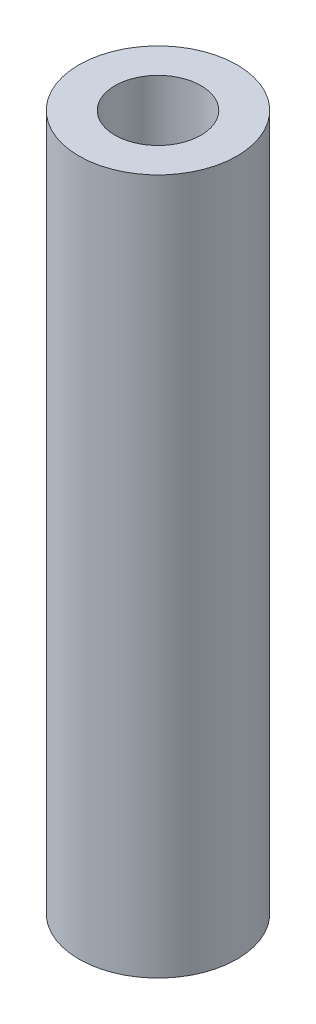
ISO-10303-21;
HEADER;
FILE_DESCRIPTION(('STEP AP214'),'2;1');
FILE_NAME('part.step','',(''),(''),'','','');
FILE_SCHEMA(('AUTOMOTIVE_DESIGN { 1 0 10303 214 1 1 1 1 }'));
ENDSEC;
DATA;
#1=APPLICATION_CONTEXT('core data for automotive mechanical design processes');
#2=APPLICATION_PROTOCOL_DEFINITION('international standard','automotive_design',2000,#1);
#3=PRODUCT_CONTEXT('',#1,'mechanical');
#4=PRODUCT('Part','Part','',(#3));
#5=PRODUCT_RELATED_PRODUCT_CATEGORY('part','',(#4));
#6=PRODUCT_DEFINITION_FORMATION('','',#4);
#7=PRODUCT_DEFINITION_CONTEXT('part definition',#1,'design');
#8=PRODUCT_DEFINITION('design','',#6,#7);
#9=PRODUCT_DEFINITION_SHAPE('','',#8);
#10=(LENGTH_UNIT() NAMED_UNIT(*) SI_UNIT(.MILLI.,.METRE.));
#11=(NAMED_UNIT(*) PLANE_ANGLE_UNIT() SI_UNIT($,.RADIAN.));
#12=(NAMED_UNIT(*) SI_UNIT($,.STERADIAN.) SOLID_ANGLE_UNIT());
#13=UNCERTAINTY_MEASURE_WITH_UNIT(LENGTH_MEASURE(1.E-05),#10,'distance_accuracy_value','');
#14=(GEOMETRIC_REPRESENTATION_CONTEXT(3) GLOBAL_UNCERTAINTY_ASSIGNED_CONTEXT((#13)) GLOBAL_UNIT_ASSIGNED_CONTEXT((#10,
#11,#12)) REPRESENTATION_CONTEXT('',''));
#15=CARTESIAN_POINT('',(0.,0.,0.));
#16=DIRECTION('',(0.,0.,1.));
#17=DIRECTION('',(1.,0.,0.));
#18=AXIS2_PLACEMENT_3D('',#15,#16,#17);
#19=CARTESIAN_POINT('',(0.,-27.94,0.));
#20=DIRECTION('',(0.,1.,0.));
#21=DIRECTION('',(0.,0.,1.));
#22=AXIS2_PLACEMENT_3D('',#19,#20,#21);
#23=CYLINDRICAL_SURFACE('',#22,3.175);
#24=CARTESIAN_POINT('',(0.,-27.94,0.));
#25=DIRECTION('',(0.,1.,0.));
#26=DIRECTION('',(0.,0.,1.));
#27=AXIS2_PLACEMENT_3D('',#24,#25,#26);
#28=CIRCLE('',#27,3.175);
#29=CARTESIAN_POINT('',(0.,-27.94,3.175));
#30=VERTEX_POINT('',#29);
#31=EDGE_CURVE('E11',#30,#30,#28,.T.);
#32=ORIENTED_EDGE('',*,*,#31,.T.);
#33=EDGE_LOOP('',(#32));
#34=FACE_BOUND('',#33,.T.);
#35=CARTESIAN_POINT('',(0.,0.,0.));
#36=DIRECTION('',(0.,1.,0.));
#37=DIRECTION('',(0.,0.,1.));
#38=AXIS2_PLACEMENT_3D('',#35,#36,#37);
#39=CIRCLE('',#38,3.175);
#40=CARTESIAN_POINT('',(0.,0.,3.175));
#41=VERTEX_POINT('',#40);
#42=EDGE_CURVE('E40',#41,#41,#39,.T.);
#43=ORIENTED_EDGE('',*,*,#42,.F.);
#44=EDGE_LOOP('',(#43));
#45=FACE_BOUND('',#44,.T.);
#46=ADVANCED_FACE('F37',(#34,#45),#23,.T.);
#47=CARTESIAN_POINT('',(0.,-27.94,0.));
#48=DIRECTION('',(0.,1.,0.));
#49=DIRECTION('',(0.,0.,1.));
#50=AXIS2_PLACEMENT_3D('',#47,#48,#49);
#51=PLANE('',#50);
#52=CARTESIAN_POINT('',(0.,-27.94,0.));
#53=DIRECTION('',(0.,-1.,0.));
#54=DIRECTION('',(0.,0.,-1.));
#55=AXIS2_PLACEMENT_3D('',#52,#53,#54);
#56=CIRCLE('',#55,1.72719999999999);
#57=CARTESIAN_POINT('',(0.,-27.94,-1.72719999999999));
#58=VERTEX_POINT('',#57);
#59=EDGE_CURVE('E59',#58,#58,#56,.T.);
#60=ORIENTED_EDGE('',*,*,#59,.F.);
#61=EDGE_LOOP('',(#60));
#62=FACE_BOUND('',#61,.T.);
#63=ORIENTED_EDGE('',*,*,#31,.F.);
#64=EDGE_LOOP('',(#63));
#65=FACE_BOUND('',#64,.T.);
#66=ADVANCED_FACE('F77',(#62,#65),#51,.F.);
#67=CARTESIAN_POINT('',(0.,0.,0.));
#68=DIRECTION('',(0.,1.,0.));
#69=DIRECTION('',(0.,0.,1.));
#70=AXIS2_PLACEMENT_3D('',#67,#68,#69);
#71=PLANE('',#70);
#72=CARTESIAN_POINT('',(0.,0.,0.));
#73=DIRECTION('',(0.,1.,0.));
#74=DIRECTION('',(0.,0.,1.));
#75=AXIS2_PLACEMENT_3D('',#72,#73,#74);
#76=CIRCLE('',#75,1.72719999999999);
#77=CARTESIAN_POINT('',(0.,0.,1.72719999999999));
#78=VERTEX_POINT('',#77);
#79=EDGE_CURVE('E67',#78,#78,#76,.T.);
#80=ORIENTED_EDGE('',*,*,#79,.F.);
#81=EDGE_LOOP('',(#80));
#82=FACE_BOUND('',#81,.T.);
#83=ORIENTED_EDGE('',*,*,#42,.T.);
#84=EDGE_LOOP('',(#83));
#85=FACE_BOUND('',#84,.T.);
#86=ADVANCED_FACE('F74',(#82,#85),#71,.T.);
#87=CARTESIAN_POINT('',(0.,0.,0.));
#88=DIRECTION('',(0.,1.,0.));
#89=DIRECTION('',(0.,0.,1.));
#90=AXIS2_PLACEMENT_3D('',#87,#88,#89);
#91=CYLINDRICAL_SURFACE('',#90,1.72719999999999);
#92=CARTESIAN_POINT('',(0.,-12.2936,0.));
#93=DIRECTION('',(0.,1.,0.));
#94=DIRECTION('',(0.,0.,1.));
#95=AXIS2_PLACEMENT_3D('',#92,#93,#94);
#96=CIRCLE('',#95,1.72719999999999);
#97=CARTESIAN_POINT('',(0.,-12.2936,1.72719999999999));
#98=VERTEX_POINT('',#97);
#99=EDGE_CURVE('E62',#98,#98,#96,.T.);
#100=ORIENTED_EDGE('',*,*,#99,.F.);
#101=EDGE_LOOP('',(#100));
#102=FACE_BOUND('',#101,.T.);
#103=ORIENTED_EDGE('',*,*,#79,.T.);
#104=EDGE_LOOP('',(#103));
#105=FACE_BOUND('',#104,.T.);
#106=ADVANCED_FACE('F89',(#102,#105),#91,.F.);
#107=CARTESIAN_POINT('',(0.,-12.2936,0.));
#108=DIRECTION('',(0.,1.,0.));
#109=DIRECTION('',(0.,0.,1.));
#110=AXIS2_PLACEMENT_3D('',#107,#108,#109);
#111=CONICAL_SURFACE('',#110,1.72719999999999,1.02974425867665);
#112=CARTESIAN_POINT('',(0.,-13.3314064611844,0.));
#113=VERTEX_POINT('',#112);
#114=VERTEX_LOOP('',#113);
#115=FACE_BOUND('',#114,.T.);
#116=ORIENTED_EDGE('',*,*,#99,.T.);
#117=EDGE_LOOP('',(#116));
#118=FACE_BOUND('',#117,.T.);
#119=ADVANCED_FACE('F95',(#115,#118),#111,.F.);
#120=CARTESIAN_POINT('',(0.,-27.94,0.));
#121=DIRECTION('',(0.,-1.,0.));
#122=DIRECTION('',(0.,0.,-1.));
#123=AXIS2_PLACEMENT_3D('',#120,#121,#122);
#124=CYLINDRICAL_SURFACE('',#123,1.72719999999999);
#125=CARTESIAN_POINT('',(0.,-15.6464,0.));
#126=DIRECTION('',(0.,-1.,0.));
#127=DIRECTION('',(0.,0.,-1.));
#128=AXIS2_PLACEMENT_3D('',#125,#126,#127);
#129=CIRCLE('',#128,1.72719999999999);
#130=CARTESIAN_POINT('',(0.,-15.6464,-1.72719999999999));
#131=VERTEX_POINT('',#130);
#132=EDGE_CURVE('E57',#131,#131,#129,.T.);
#133=ORIENTED_EDGE('',*,*,#132,.F.);
#134=EDGE_LOOP('',(#133));
#135=FACE_BOUND('',#134,.T.);
#136=ORIENTED_EDGE('',*,*,#59,.T.);
#137=EDGE_LOOP('',(#136));
#138=FACE_BOUND('',#137,.T.);
#139=ADVANCED_FACE('F53',(#135,#138),#124,.F.);
#140=CARTESIAN_POINT('',(0.,-15.6464,0.));
#141=DIRECTION('',(0.,-1.,0.));
#142=DIRECTION('',(0.,0.,-1.));
#143=AXIS2_PLACEMENT_3D('',#140,#141,#142);
#144=CONICAL_SURFACE('',#143,1.72719999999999,1.02974425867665);
#145=CARTESIAN_POINT('',(0.,-14.6085935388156,0.));
#146=VERTEX_POINT('',#145);
#147=VERTEX_LOOP('',#146);
#148=FACE_BOUND('',#147,.T.);
#149=ORIENTED_EDGE('',*,*,#132,.T.);
#150=EDGE_LOOP('',(#149));
#151=FACE_BOUND('',#150,.T.);
#152=ADVANCED_FACE('F50',(#148,#151),#144,.F.);
#153=CLOSED_SHELL('',(#46,#66,#86,#106,#119,#139,#152));
#154=MANIFOLD_SOLID_BREP('B2',#153);
#155=ADVANCED_BREP_SHAPE_REPRESENTATION('',(#18,#154),#14);
#156=SHAPE_DEFINITION_REPRESENTATION(#9,#155);
ENDSEC;
END-ISO-10303-21;
